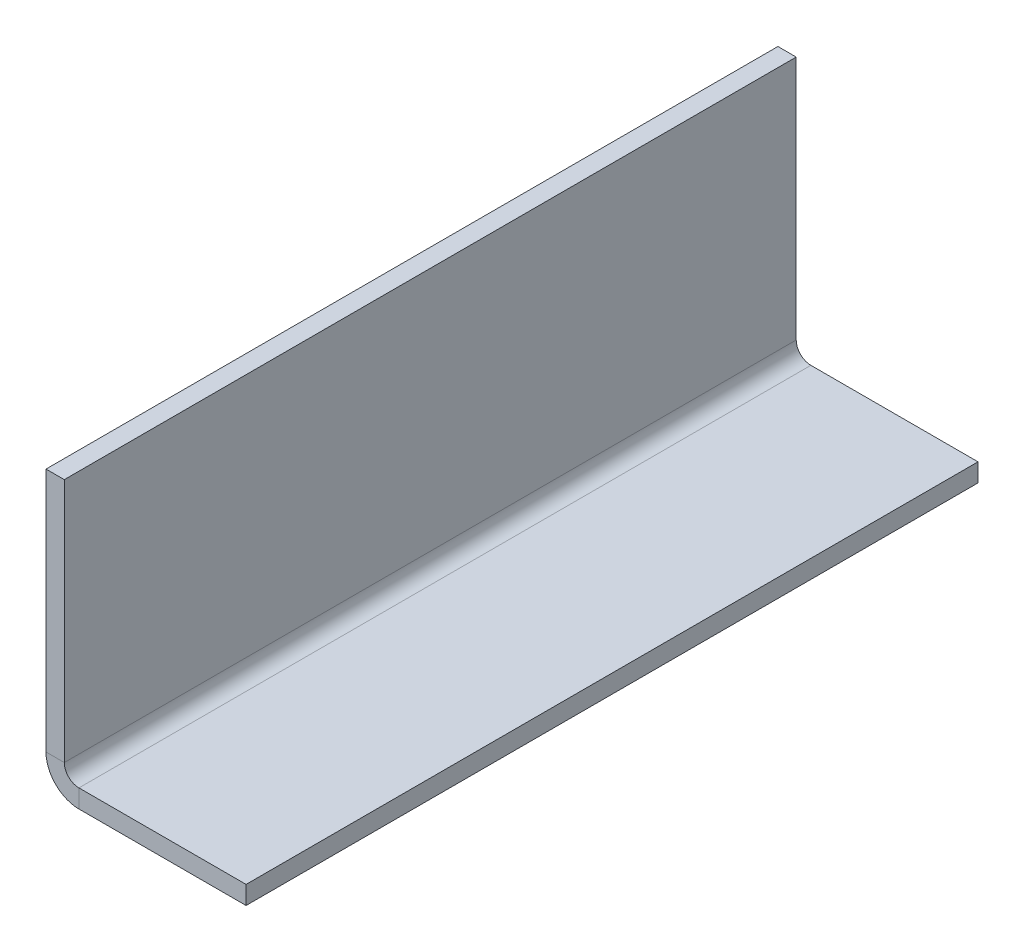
ISO-10303-21;
HEADER;
FILE_DESCRIPTION(('STEP AP214'),'2;1');
FILE_NAME('part.step','',(''),(''),'','','');
FILE_SCHEMA(('AUTOMOTIVE_DESIGN { 1 0 10303 214 1 1 1 1 }'));
ENDSEC;
DATA;
#1=APPLICATION_CONTEXT('core data for automotive mechanical design processes');
#2=APPLICATION_PROTOCOL_DEFINITION('international standard','automotive_design',2000,#1);
#3=PRODUCT_CONTEXT('',#1,'mechanical');
#4=PRODUCT('Part','Part','',(#3));
#5=PRODUCT_RELATED_PRODUCT_CATEGORY('part','',(#4));
#6=PRODUCT_DEFINITION_FORMATION('','',#4);
#7=PRODUCT_DEFINITION_CONTEXT('part definition',#1,'design');
#8=PRODUCT_DEFINITION('design','',#6,#7);
#9=PRODUCT_DEFINITION_SHAPE('','',#8);
#10=(LENGTH_UNIT() NAMED_UNIT(*) SI_UNIT(.MILLI.,.METRE.));
#11=(NAMED_UNIT(*) PLANE_ANGLE_UNIT() SI_UNIT($,.RADIAN.));
#12=(NAMED_UNIT(*) SI_UNIT($,.STERADIAN.) SOLID_ANGLE_UNIT());
#13=UNCERTAINTY_MEASURE_WITH_UNIT(LENGTH_MEASURE(1.E-05),#10,'distance_accuracy_value','');
#14=(GEOMETRIC_REPRESENTATION_CONTEXT(3) GLOBAL_UNCERTAINTY_ASSIGNED_CONTEXT((#13)) GLOBAL_UNIT_ASSIGNED_CONTEXT((#10,
#11,#12)) REPRESENTATION_CONTEXT('',''));
#15=CARTESIAN_POINT('',(0.,0.,0.));
#16=DIRECTION('',(0.,0.,1.));
#17=DIRECTION('',(1.,0.,0.));
#18=AXIS2_PLACEMENT_3D('',#15,#16,#17);
#19=CARTESIAN_POINT('',(0.,4.5,50.));
#20=DIRECTION('',(0.,0.,1.));
#21=DIRECTION('',(1.,0.,0.));
#22=AXIS2_PLACEMENT_3D('',#19,#20,#21);
#23=PLANE('',#22);
#24=DIRECTION('',(1.,0.,0.));
#25=VECTOR('',#24,1.);
#26=CARTESIAN_POINT('',(0.,4.5,50.));
#27=LINE('',#26,#25);
#28=CARTESIAN_POINT('',(0.,4.5,50.));
#29=VERTEX_POINT('',#28);
#30=CARTESIAN_POINT('',(2.5,4.5,50.));
#31=VERTEX_POINT('',#30);
#32=EDGE_CURVE('E11',#29,#31,#27,.T.);
#33=ORIENTED_EDGE('',*,*,#32,.F.);
#34=CARTESIAN_POINT('',(4.5,4.5,50.));
#35=DIRECTION('',(0.,0.,1.));
#36=DIRECTION('',(1.,0.,0.));
#37=AXIS2_PLACEMENT_3D('',#34,#35,#36);
#38=CIRCLE('',#37,4.5);
#39=CARTESIAN_POINT('',(4.5,0.,50.));
#40=VERTEX_POINT('',#39);
#41=EDGE_CURVE('E132',#40,#29,#38,.F.);
#42=ORIENTED_EDGE('',*,*,#41,.F.);
#43=DIRECTION('',(0.,-1.,0.));
#44=VECTOR('',#43,1.);
#45=CARTESIAN_POINT('',(4.5,2.5,50.));
#46=LINE('',#45,#44);
#47=CARTESIAN_POINT('',(4.5,2.5,50.));
#48=VERTEX_POINT('',#47);
#49=EDGE_CURVE('E43',#48,#40,#46,.T.);
#50=ORIENTED_EDGE('',*,*,#49,.F.);
#51=CARTESIAN_POINT('',(4.5,4.5,50.));
#52=DIRECTION('',(0.,0.,1.));
#53=DIRECTION('',(1.,0.,0.));
#54=AXIS2_PLACEMENT_3D('',#51,#52,#53);
#55=CIRCLE('',#54,2.);
#56=EDGE_CURVE('E125',#48,#31,#55,.F.);
#57=ORIENTED_EDGE('',*,*,#56,.T.);
#58=EDGE_LOOP('',(#33,#42,#50,#57));
#59=FACE_BOUND('',#58,.T.);
#60=ADVANCED_FACE('F35',(#59),#23,.T.);
#61=CARTESIAN_POINT('',(4.5,2.5,50.));
#62=DIRECTION('',(0.,0.,1.));
#63=DIRECTION('',(1.,0.,0.));
#64=AXIS2_PLACEMENT_3D('',#61,#62,#63);
#65=PLANE('',#64);
#66=DIRECTION('',(0.,1.,0.));
#67=VECTOR('',#66,1.);
#68=CARTESIAN_POINT('',(0.,0.,50.));
#69=LINE('',#68,#67);
#70=CARTESIAN_POINT('',(0.,37.9755592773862,50.));
#71=VERTEX_POINT('',#70);
#72=EDGE_CURVE('E181',#29,#71,#69,.T.);
#73=ORIENTED_EDGE('',*,*,#72,.F.);
#74=ORIENTED_EDGE('',*,*,#32,.T.);
#75=DIRECTION('',(0.,1.,0.));
#76=VECTOR('',#75,1.);
#77=CARTESIAN_POINT('',(2.5,0.,50.));
#78=LINE('',#77,#76);
#79=CARTESIAN_POINT('',(2.5,37.9755592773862,50.));
#80=VERTEX_POINT('',#79);
#81=EDGE_CURVE('E91',#31,#80,#78,.T.);
#82=ORIENTED_EDGE('',*,*,#81,.T.);
#83=DIRECTION('',(1.,0.,0.));
#84=VECTOR('',#83,1.);
#85=CARTESIAN_POINT('',(0.,37.9755592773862,50.));
#86=LINE('',#85,#84);
#87=EDGE_CURVE('E338',#71,#80,#86,.T.);
#88=ORIENTED_EDGE('',*,*,#87,.F.);
#89=EDGE_LOOP('',(#73,#74,#82,#88));
#90=FACE_BOUND('',#89,.T.);
#91=ADVANCED_FACE('F189',(#90),#65,.T.);
#92=CARTESIAN_POINT('',(4.5,0.,-50.));
#93=DIRECTION('',(0.,0.,-1.));
#94=DIRECTION('',(-1.,0.,0.));
#95=AXIS2_PLACEMENT_3D('',#92,#93,#94);
#96=PLANE('',#95);
#97=DIRECTION('',(0.,1.,0.));
#98=VECTOR('',#97,1.);
#99=CARTESIAN_POINT('',(4.5,0.,-50.));
#100=LINE('',#99,#98);
#101=CARTESIAN_POINT('',(4.5,0.,-50.));
#102=VERTEX_POINT('',#101);
#103=CARTESIAN_POINT('',(4.5,2.5,-50.));
#104=VERTEX_POINT('',#103);
#105=EDGE_CURVE('E78',#102,#104,#100,.T.);
#106=ORIENTED_EDGE('',*,*,#105,.F.);
#107=CARTESIAN_POINT('',(4.5,4.5,-50.));
#108=DIRECTION('',(0.,0.,1.));
#109=DIRECTION('',(1.,0.,0.));
#110=AXIS2_PLACEMENT_3D('',#107,#108,#109);
#111=CIRCLE('',#110,4.5);
#112=CARTESIAN_POINT('',(0.,4.5,-50.));
#113=VERTEX_POINT('',#112);
#114=EDGE_CURVE('E147',#102,#113,#111,.F.);
#115=ORIENTED_EDGE('',*,*,#114,.T.);
#116=DIRECTION('',(-1.,0.,0.));
#117=VECTOR('',#116,1.);
#118=CARTESIAN_POINT('',(2.5,4.5,-50.));
#119=LINE('',#118,#117);
#120=CARTESIAN_POINT('',(2.5,4.5,-50.));
#121=VERTEX_POINT('',#120);
#122=EDGE_CURVE('E85',#121,#113,#119,.T.);
#123=ORIENTED_EDGE('',*,*,#122,.F.);
#124=CARTESIAN_POINT('',(4.5,4.5,-50.));
#125=DIRECTION('',(0.,0.,1.));
#126=DIRECTION('',(1.,0.,0.));
#127=AXIS2_PLACEMENT_3D('',#124,#125,#126);
#128=CIRCLE('',#127,2.);
#129=EDGE_CURVE('E154',#104,#121,#128,.F.);
#130=ORIENTED_EDGE('',*,*,#129,.F.);
#131=EDGE_LOOP('',(#106,#115,#123,#130));
#132=FACE_BOUND('',#131,.T.);
#133=ADVANCED_FACE('F187',(#132),#96,.T.);
#134=CARTESIAN_POINT('',(2.5,4.5,-50.));
#135=DIRECTION('',(0.,0.,-1.));
#136=DIRECTION('',(-1.,0.,0.));
#137=AXIS2_PLACEMENT_3D('',#134,#135,#136);
#138=PLANE('',#137);
#139=DIRECTION('',(-1.,0.,0.));
#140=VECTOR('',#139,1.);
#141=CARTESIAN_POINT('',(27.3358551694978,0.,-50.));
#142=LINE('',#141,#140);
#143=CARTESIAN_POINT('',(27.3358551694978,0.,-50.));
#144=VERTEX_POINT('',#143);
#145=EDGE_CURVE('E149',#144,#102,#142,.T.);
#146=ORIENTED_EDGE('',*,*,#145,.T.);
#147=ORIENTED_EDGE('',*,*,#105,.T.);
#148=DIRECTION('',(1.,0.,0.));
#149=VECTOR('',#148,1.);
#150=CARTESIAN_POINT('',(27.3358551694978,2.5,-50.));
#151=LINE('',#150,#149);
#152=CARTESIAN_POINT('',(27.3358551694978,2.5,-50.));
#153=VERTEX_POINT('',#152);
#154=EDGE_CURVE('E152',#153,#104,#151,.F.);
#155=ORIENTED_EDGE('',*,*,#154,.F.);
#156=DIRECTION('',(0.,-1.,0.));
#157=VECTOR('',#156,1.);
#158=CARTESIAN_POINT('',(27.3358551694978,2.5,-50.));
#159=LINE('',#158,#157);
#160=EDGE_CURVE('E113',#153,#144,#159,.T.);
#161=ORIENTED_EDGE('',*,*,#160,.T.);
#162=EDGE_LOOP('',(#146,#147,#155,#161));
#163=FACE_BOUND('',#162,.T.);
#164=ADVANCED_FACE('F183',(#163),#138,.T.);
#165=CARTESIAN_POINT('',(2.5,0.,50.));
#166=DIRECTION('',(-1.,0.,0.));
#167=DIRECTION('',(0.,0.,1.));
#168=AXIS2_PLACEMENT_3D('',#165,#166,#167);
#169=PLANE('',#168);
#170=DIRECTION('',(0.,1.,0.));
#171=VECTOR('',#170,1.);
#172=CARTESIAN_POINT('',(2.5,0.,-50.));
#173=LINE('',#172,#171);
#174=CARTESIAN_POINT('',(2.5,37.9755592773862,-50.));
#175=VERTEX_POINT('',#174);
#176=EDGE_CURVE('E138',#121,#175,#173,.T.);
#177=ORIENTED_EDGE('',*,*,#176,.T.);
#178=DIRECTION('',(0.,0.,-1.));
#179=VECTOR('',#178,1.);
#180=CARTESIAN_POINT('',(2.5,37.9755592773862,50.));
#181=LINE('',#180,#179);
#182=EDGE_CURVE('E168',#80,#175,#181,.T.);
#183=ORIENTED_EDGE('',*,*,#182,.F.);
#184=ORIENTED_EDGE('',*,*,#81,.F.);
#185=DIRECTION('',(0.,0.,-1.));
#186=VECTOR('',#185,1.);
#187=CARTESIAN_POINT('',(2.5,4.5,50.));
#188=LINE('',#187,#186);
#189=EDGE_CURVE('E137',#31,#121,#188,.T.);
#190=ORIENTED_EDGE('',*,*,#189,.T.);
#191=EDGE_LOOP('',(#177,#183,#184,#190));
#192=FACE_BOUND('',#191,.T.);
#193=ADVANCED_FACE('F195',(#192),#169,.F.);
#194=CARTESIAN_POINT('',(0.,37.9755592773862,50.));
#195=DIRECTION('',(0.,1.,0.));
#196=DIRECTION('',(0.,0.,1.));
#197=AXIS2_PLACEMENT_3D('',#194,#195,#196);
#198=PLANE('',#197);
#199=DIRECTION('',(1.,0.,0.));
#200=VECTOR('',#199,1.);
#201=CARTESIAN_POINT('',(0.,37.9755592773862,-50.));
#202=LINE('',#201,#200);
#203=CARTESIAN_POINT('',(0.,37.9755592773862,-50.));
#204=VERTEX_POINT('',#203);
#205=EDGE_CURVE('E141',#204,#175,#202,.T.);
#206=ORIENTED_EDGE('',*,*,#205,.F.);
#207=DIRECTION('',(0.,0.,-1.));
#208=VECTOR('',#207,1.);
#209=CARTESIAN_POINT('',(0.,37.9755592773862,50.));
#210=LINE('',#209,#208);
#211=EDGE_CURVE('E166',#71,#204,#210,.T.);
#212=ORIENTED_EDGE('',*,*,#211,.F.);
#213=ORIENTED_EDGE('',*,*,#87,.T.);
#214=ORIENTED_EDGE('',*,*,#182,.T.);
#215=EDGE_LOOP('',(#206,#212,#213,#214));
#216=FACE_BOUND('',#215,.T.);
#217=ADVANCED_FACE('F226',(#216),#198,.T.);
#218=CARTESIAN_POINT('',(0.,0.,50.));
#219=DIRECTION('',(-1.,0.,0.));
#220=DIRECTION('',(0.,0.,1.));
#221=AXIS2_PLACEMENT_3D('',#218,#219,#220);
#222=PLANE('',#221);
#223=DIRECTION('',(0.,1.,0.));
#224=VECTOR('',#223,1.);
#225=CARTESIAN_POINT('',(0.,0.,-50.));
#226=LINE('',#225,#224);
#227=EDGE_CURVE('E144',#113,#204,#226,.T.);
#228=ORIENTED_EDGE('',*,*,#227,.F.);
#229=DIRECTION('',(0.,0.,-1.));
#230=VECTOR('',#229,1.);
#231=CARTESIAN_POINT('',(0.,4.5,50.));
#232=LINE('',#231,#230);
#233=EDGE_CURVE('E163',#29,#113,#232,.T.);
#234=ORIENTED_EDGE('',*,*,#233,.F.);
#235=ORIENTED_EDGE('',*,*,#72,.T.);
#236=ORIENTED_EDGE('',*,*,#211,.T.);
#237=EDGE_LOOP('',(#228,#234,#235,#236));
#238=FACE_BOUND('',#237,.T.);
#239=ADVANCED_FACE('F237',(#238),#222,.T.);
#240=CARTESIAN_POINT('',(4.5,4.5,50.));
#241=DIRECTION('',(0.,0.,-1.));
#242=DIRECTION('',(-1.,0.,0.));
#243=AXIS2_PLACEMENT_3D('',#240,#241,#242);
#244=CYLINDRICAL_SURFACE('',#243,4.5);
#245=ORIENTED_EDGE('',*,*,#114,.F.);
#246=DIRECTION('',(0.,0.,-1.));
#247=VECTOR('',#246,1.);
#248=CARTESIAN_POINT('',(4.5,0.,50.));
#249=LINE('',#248,#247);
#250=EDGE_CURVE('E160',#40,#102,#249,.T.);
#251=ORIENTED_EDGE('',*,*,#250,.F.);
#252=ORIENTED_EDGE('',*,*,#41,.T.);
#253=ORIENTED_EDGE('',*,*,#233,.T.);
#254=EDGE_LOOP('',(#245,#251,#252,#253));
#255=FACE_BOUND('',#254,.T.);
#256=ADVANCED_FACE('F177',(#255),#244,.T.);
#257=CARTESIAN_POINT('',(27.3358551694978,0.,50.));
#258=DIRECTION('',(0.,-1.,0.));
#259=DIRECTION('',(0.,0.,-1.));
#260=AXIS2_PLACEMENT_3D('',#257,#258,#259);
#261=PLANE('',#260);
#262=ORIENTED_EDGE('',*,*,#145,.F.);
#263=DIRECTION('',(0.,0.,-1.));
#264=VECTOR('',#263,1.);
#265=CARTESIAN_POINT('',(27.3358551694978,0.,50.));
#266=LINE('',#265,#264);
#267=CARTESIAN_POINT('',(27.3358551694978,0.,50.));
#268=VERTEX_POINT('',#267);
#269=EDGE_CURVE('E115',#268,#144,#266,.T.);
#270=ORIENTED_EDGE('',*,*,#269,.F.);
#271=DIRECTION('',(-1.,0.,0.));
#272=VECTOR('',#271,1.);
#273=CARTESIAN_POINT('',(27.3358551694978,0.,50.));
#274=LINE('',#273,#272);
#275=EDGE_CURVE('E130',#268,#40,#274,.T.);
#276=ORIENTED_EDGE('',*,*,#275,.T.);
#277=ORIENTED_EDGE('',*,*,#250,.T.);
#278=EDGE_LOOP('',(#262,#270,#276,#277));
#279=FACE_BOUND('',#278,.T.);
#280=ADVANCED_FACE('F182',(#279),#261,.T.);
#281=CARTESIAN_POINT('',(27.3358551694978,2.5,50.));
#282=DIRECTION('',(1.,0.,0.));
#283=DIRECTION('',(0.,0.,-1.));
#284=AXIS2_PLACEMENT_3D('',#281,#282,#283);
#285=PLANE('',#284);
#286=ORIENTED_EDGE('',*,*,#160,.F.);
#287=DIRECTION('',(0.,0.,-1.));
#288=VECTOR('',#287,1.);
#289=CARTESIAN_POINT('',(27.3358551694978,2.5,50.));
#290=LINE('',#289,#288);
#291=CARTESIAN_POINT('',(27.3358551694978,2.5,50.));
#292=VERTEX_POINT('',#291);
#293=EDGE_CURVE('E107',#292,#153,#290,.T.);
#294=ORIENTED_EDGE('',*,*,#293,.F.);
#295=DIRECTION('',(0.,-1.,0.));
#296=VECTOR('',#295,1.);
#297=CARTESIAN_POINT('',(27.3358551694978,2.5,50.));
#298=LINE('',#297,#296);
#299=EDGE_CURVE('E111',#292,#268,#298,.T.);
#300=ORIENTED_EDGE('',*,*,#299,.T.);
#301=ORIENTED_EDGE('',*,*,#269,.T.);
#302=EDGE_LOOP('',(#286,#294,#300,#301));
#303=FACE_BOUND('',#302,.T.);
#304=ADVANCED_FACE('F109',(#303),#285,.T.);
#305=CARTESIAN_POINT('',(27.3358551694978,2.5,50.));
#306=DIRECTION('',(0.,-1.,0.));
#307=DIRECTION('',(0.,0.,-1.));
#308=AXIS2_PLACEMENT_3D('',#305,#306,#307);
#309=PLANE('',#308);
#310=ORIENTED_EDGE('',*,*,#154,.T.);
#311=DIRECTION('',(0.,0.,-1.));
#312=VECTOR('',#311,1.);
#313=CARTESIAN_POINT('',(4.5,2.5,50.));
#314=LINE('',#313,#312);
#315=EDGE_CURVE('E116',#48,#104,#314,.T.);
#316=ORIENTED_EDGE('',*,*,#315,.F.);
#317=DIRECTION('',(1.,0.,0.));
#318=VECTOR('',#317,1.);
#319=CARTESIAN_POINT('',(27.3358551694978,2.5,50.));
#320=LINE('',#319,#318);
#321=EDGE_CURVE('E120',#292,#48,#320,.F.);
#322=ORIENTED_EDGE('',*,*,#321,.F.);
#323=ORIENTED_EDGE('',*,*,#293,.T.);
#324=EDGE_LOOP('',(#310,#316,#322,#323));
#325=FACE_BOUND('',#324,.T.);
#326=ADVANCED_FACE('F121',(#325),#309,.F.);
#327=CARTESIAN_POINT('',(4.5,4.5,50.));
#328=DIRECTION('',(0.,0.,-1.));
#329=DIRECTION('',(-1.,0.,0.));
#330=AXIS2_PLACEMENT_3D('',#327,#328,#329);
#331=CYLINDRICAL_SURFACE('',#330,2.);
#332=ORIENTED_EDGE('',*,*,#129,.T.);
#333=ORIENTED_EDGE('',*,*,#189,.F.);
#334=ORIENTED_EDGE('',*,*,#56,.F.);
#335=ORIENTED_EDGE('',*,*,#315,.T.);
#336=EDGE_LOOP('',(#332,#333,#334,#335));
#337=FACE_BOUND('',#336,.T.);
#338=ADVANCED_FACE('F185',(#337),#331,.F.);
#339=CARTESIAN_POINT('',(4.5,4.5,50.));
#340=DIRECTION('',(0.,0.,1.));
#341=DIRECTION('',(1.,0.,0.));
#342=AXIS2_PLACEMENT_3D('',#339,#340,#341);
#343=PLANE('',#342);
#344=ORIENTED_EDGE('',*,*,#321,.T.);
#345=ORIENTED_EDGE('',*,*,#49,.T.);
#346=ORIENTED_EDGE('',*,*,#275,.F.);
#347=ORIENTED_EDGE('',*,*,#299,.F.);
#348=EDGE_LOOP('',(#344,#345,#346,#347));
#349=FACE_BOUND('',#348,.T.);
#350=ADVANCED_FACE('F128',(#349),#343,.T.);
#351=CARTESIAN_POINT('',(4.5,4.5,-50.));
#352=DIRECTION('',(0.,0.,1.));
#353=DIRECTION('',(1.,0.,0.));
#354=AXIS2_PLACEMENT_3D('',#351,#352,#353);
#355=PLANE('',#354);
#356=ORIENTED_EDGE('',*,*,#176,.F.);
#357=ORIENTED_EDGE('',*,*,#122,.T.);
#358=ORIENTED_EDGE('',*,*,#227,.T.);
#359=ORIENTED_EDGE('',*,*,#205,.T.);
#360=EDGE_LOOP('',(#356,#357,#358,#359));
#361=FACE_BOUND('',#360,.T.);
#362=ADVANCED_FACE('F303',(#361),#355,.F.);
#363=CLOSED_SHELL('',(#60,#91,#133,#164,#193,#217,#239,#256,#280,#304,#326,#338,#350,#362));
#364=MANIFOLD_SOLID_BREP('B2',#363);
#365=ADVANCED_BREP_SHAPE_REPRESENTATION('',(#18,#364),#14);
#366=SHAPE_DEFINITION_REPRESENTATION(#9,#365);
ENDSEC;
END-ISO-10303-21;
